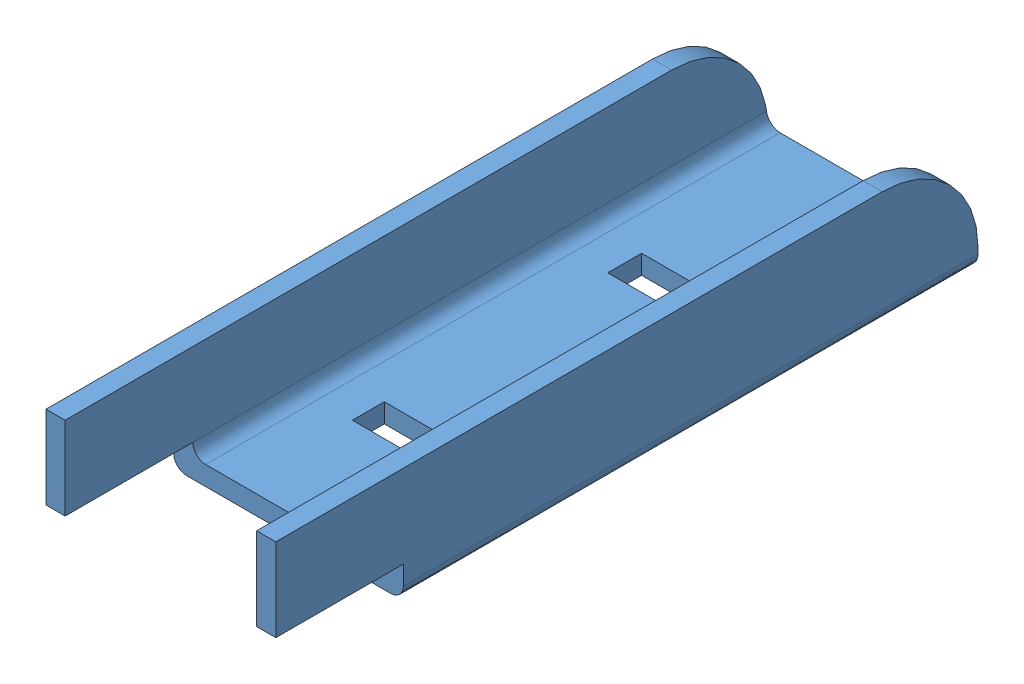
SolidWorks assembly Ass1_poteau_gond.SLDASM, configuration Défaut (file format 3800). Lengths in mm.
Overall size (36 27 110).
3 component instances, 2 part files, 8 mates.
Components (placement in the parent):
- poteau_bis-1: poteau_bis.SLDPRT [Défaut] at (-24.972 6.6916 55) size (36 18 110)
- gond_marron-1: gond_marron.SLDPRT [Défaut] at (-2.472 -5.3084 12.5761) x (0 0 1) z (-1 0 0) size (20 15 10)
- gond_marron-2: gond_marron.SLDPRT [Défaut] at (-2.472 -5.3084 -26.9968) x (0 0 1) z (-1 0 0) size (20 15 10)
Mates (geometry in assembly coordinates):
- Coïncidente1: coincident anti-aligned: plane of poteau_bis-1 through (-24.972 6.6916 -55) normal (0 1 0); plane of gond_marron-1 through (-12.472 6.6916 12.5761) normal (0 -1 0)
- Parallèle2: parallel aligned: line of poteau_bis-1; line of gond_marron-1
- Parallèle3: parallel aligned: line of poteau_bis-1; line of gond_marron-1
- Coïncidente16: coincident: plane of poteau_bis-1 through (-2.472 113.6916 17.5) normal (-1 0 0); line of gond_marron-1
- Coïncidente17: coincident anti-aligned: plane of gond_marron-2 through (-12.472 6.6916 -26.9968) normal (0 -1 0); plane of poteau_bis-1 through (-24.972 6.6916 -55) normal (0 1 0)
- Parallèle4: parallel aligned: line of poteau_bis-1; line of gond_marron-2
- Parallèle5: parallel aligned: line of poteau_bis-1; line of gond_marron-2
- Coïncidente22: coincident: plane of poteau_bis-1 through (-2.472 113.6916 -27.8066) normal (-1 0 0); line of gond_marron-2
